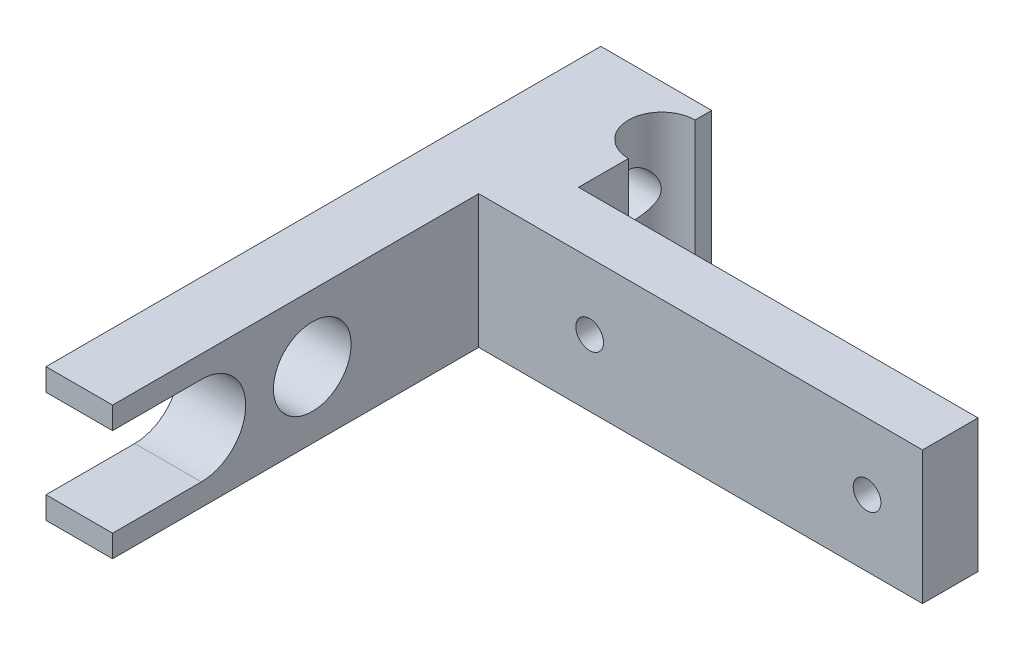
ISO-10303-21;
HEADER;
FILE_DESCRIPTION(('STEP AP214'),'2;1');
FILE_NAME('part.step','',(''),(''),'','','');
FILE_SCHEMA(('AUTOMOTIVE_DESIGN { 1 0 10303 214 1 1 1 1 }'));
ENDSEC;
DATA;
#1=APPLICATION_CONTEXT('core data for automotive mechanical design processes');
#2=APPLICATION_PROTOCOL_DEFINITION('international standard','automotive_design',2000,#1);
#3=PRODUCT_CONTEXT('',#1,'mechanical');
#4=PRODUCT('Part','Part','',(#3));
#5=PRODUCT_RELATED_PRODUCT_CATEGORY('part','',(#4));
#6=PRODUCT_DEFINITION_FORMATION('','',#4);
#7=PRODUCT_DEFINITION_CONTEXT('part definition',#1,'design');
#8=PRODUCT_DEFINITION('design','',#6,#7);
#9=PRODUCT_DEFINITION_SHAPE('','',#8);
#10=(LENGTH_UNIT() NAMED_UNIT(*) SI_UNIT(.MILLI.,.METRE.));
#11=(NAMED_UNIT(*) PLANE_ANGLE_UNIT() SI_UNIT($,.RADIAN.));
#12=(NAMED_UNIT(*) SI_UNIT($,.STERADIAN.) SOLID_ANGLE_UNIT());
#13=UNCERTAINTY_MEASURE_WITH_UNIT(LENGTH_MEASURE(1.E-05),#10,'distance_accuracy_value','');
#14=(GEOMETRIC_REPRESENTATION_CONTEXT(3) GLOBAL_UNCERTAINTY_ASSIGNED_CONTEXT((#13)) GLOBAL_UNIT_ASSIGNED_CONTEXT((#10,
#11,#12)) REPRESENTATION_CONTEXT('',''));
#15=CARTESIAN_POINT('',(0.,0.,0.));
#16=DIRECTION('',(0.,0.,1.));
#17=DIRECTION('',(1.,0.,0.));
#18=AXIS2_PLACEMENT_3D('',#15,#16,#17);
#19=CARTESIAN_POINT('',(-26.,6.,27.5));
#20=DIRECTION('',(-1.,0.,0.));
#21=DIRECTION('',(0.,0.,1.));
#22=AXIS2_PLACEMENT_3D('',#19,#20,#21);
#23=CYLINDRICAL_SURFACE('',#22,3.5);
#24=CARTESIAN_POINT('',(-20.,6.,27.5));
#25=DIRECTION('',(-1.,0.,0.));
#26=DIRECTION('',(0.,0.,1.));
#27=AXIS2_PLACEMENT_3D('',#24,#25,#26);
#28=CIRCLE('',#27,3.5);
#29=CARTESIAN_POINT('',(-20.,6.,31.));
#30=VERTEX_POINT('',#29);
#31=EDGE_CURVE('E198',#30,#30,#28,.T.);
#32=ORIENTED_EDGE('',*,*,#31,.F.);
#33=EDGE_LOOP('',(#32));
#34=FACE_BOUND('',#33,.T.);
#35=CARTESIAN_POINT('',(-26.,6.,27.5));
#36=DIRECTION('',(-1.,0.,0.));
#37=DIRECTION('',(0.,0.,1.));
#38=AXIS2_PLACEMENT_3D('',#35,#36,#37);
#39=CIRCLE('',#38,3.5);
#40=CARTESIAN_POINT('',(-26.,6.,31.));
#41=VERTEX_POINT('',#40);
#42=EDGE_CURVE('E297',#41,#41,#39,.T.);
#43=ORIENTED_EDGE('',*,*,#42,.T.);
#44=EDGE_LOOP('',(#43));
#45=FACE_BOUND('',#44,.T.);
#46=ADVANCED_FACE('F17',(#34,#45),#23,.F.);
#47=CARTESIAN_POINT('',(-20.,2.00000000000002,45.5));
#48=DIRECTION('',(0.,-1.,0.));
#49=DIRECTION('',(0.,0.,-1.));
#50=AXIS2_PLACEMENT_3D('',#47,#48,#49);
#51=PLANE('',#50);
#52=DIRECTION('',(-1.,0.,0.));
#53=VECTOR('',#52,1.);
#54=CARTESIAN_POINT('',(-26.,2.00000000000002,45.5));
#55=LINE('',#54,#53);
#56=CARTESIAN_POINT('',(-26.,2.00000000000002,45.5));
#57=VERTEX_POINT('',#56);
#58=CARTESIAN_POINT('',(-20.,2.00000000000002,45.5));
#59=VERTEX_POINT('',#58);
#60=EDGE_CURVE('E274',#57,#59,#55,.F.);
#61=ORIENTED_EDGE('',*,*,#60,.T.);
#62=DIRECTION('',(0.,0.,-1.));
#63=VECTOR('',#62,1.);
#64=CARTESIAN_POINT('',(-20.,2.00000000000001,0.));
#65=LINE('',#64,#63);
#66=CARTESIAN_POINT('',(-20.,2.00000000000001,37.5));
#67=VERTEX_POINT('',#66);
#68=EDGE_CURVE('E194',#67,#59,#65,.F.);
#69=ORIENTED_EDGE('',*,*,#68,.F.);
#70=DIRECTION('',(-1.,0.,0.));
#71=VECTOR('',#70,1.);
#72=CARTESIAN_POINT('',(-20.,2.00000000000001,37.5));
#73=LINE('',#72,#71);
#74=CARTESIAN_POINT('',(-26.,2.00000000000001,37.5));
#75=VERTEX_POINT('',#74);
#76=EDGE_CURVE('E249',#67,#75,#73,.T.);
#77=ORIENTED_EDGE('',*,*,#76,.T.);
#78=DIRECTION('',(0.,0.,-1.));
#79=VECTOR('',#78,1.);
#80=CARTESIAN_POINT('',(-26.,2.00000000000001,0.));
#81=LINE('',#80,#79);
#82=EDGE_CURVE('E93',#75,#57,#81,.F.);
#83=ORIENTED_EDGE('',*,*,#82,.T.);
#84=EDGE_LOOP('',(#61,#69,#77,#83));
#85=FACE_BOUND('',#84,.T.);
#86=ADVANCED_FACE('F465',(#85),#51,.F.);
#87=CARTESIAN_POINT('',(-26.,12.,45.5));
#88=DIRECTION('',(0.,0.,-1.));
#89=DIRECTION('',(-1.,0.,0.));
#90=AXIS2_PLACEMENT_3D('',#87,#88,#89);
#91=PLANE('',#90);
#92=ORIENTED_EDGE('',*,*,#60,.F.);
#93=DIRECTION('',(0.,1.,0.));
#94=VECTOR('',#93,1.);
#95=CARTESIAN_POINT('',(-26.,0.,45.5));
#96=LINE('',#95,#94);
#97=CARTESIAN_POINT('',(-26.,0.,45.5));
#98=VERTEX_POINT('',#97);
#99=EDGE_CURVE('E221',#57,#98,#96,.F.);
#100=ORIENTED_EDGE('',*,*,#99,.T.);
#101=DIRECTION('',(1.,0.,0.));
#102=VECTOR('',#101,1.);
#103=CARTESIAN_POINT('',(0.,0.,45.5));
#104=LINE('',#103,#102);
#105=CARTESIAN_POINT('',(-20.,0.,45.5));
#106=VERTEX_POINT('',#105);
#107=EDGE_CURVE('E245',#98,#106,#104,.T.);
#108=ORIENTED_EDGE('',*,*,#107,.T.);
#109=DIRECTION('',(0.,1.,0.));
#110=VECTOR('',#109,1.);
#111=CARTESIAN_POINT('',(-20.,0.,45.5));
#112=LINE('',#111,#110);
#113=EDGE_CURVE('E197',#59,#106,#112,.F.);
#114=ORIENTED_EDGE('',*,*,#113,.F.);
#115=EDGE_LOOP('',(#92,#100,#108,#114));
#116=FACE_BOUND('',#115,.T.);
#117=ADVANCED_FACE('F456',(#116),#91,.F.);
#118=CARTESIAN_POINT('',(-20.,10.,45.5));
#119=DIRECTION('',(0.,1.,0.));
#120=DIRECTION('',(0.,0.,1.));
#121=AXIS2_PLACEMENT_3D('',#118,#119,#120);
#122=PLANE('',#121);
#123=DIRECTION('',(-1.,0.,0.));
#124=VECTOR('',#123,1.);
#125=CARTESIAN_POINT('',(-20.,10.,37.5));
#126=LINE('',#125,#124);
#127=CARTESIAN_POINT('',(-26.,10.,37.5));
#128=VERTEX_POINT('',#127);
#129=CARTESIAN_POINT('',(-20.,10.,37.5));
#130=VERTEX_POINT('',#129);
#131=EDGE_CURVE('E272',#128,#130,#126,.F.);
#132=ORIENTED_EDGE('',*,*,#131,.T.);
#133=DIRECTION('',(0.,0.,-1.));
#134=VECTOR('',#133,1.);
#135=CARTESIAN_POINT('',(-20.,10.,0.));
#136=LINE('',#135,#134);
#137=CARTESIAN_POINT('',(-20.,10.,45.5));
#138=VERTEX_POINT('',#137);
#139=EDGE_CURVE('E187',#138,#130,#136,.T.);
#140=ORIENTED_EDGE('',*,*,#139,.F.);
#141=DIRECTION('',(-1.,0.,0.));
#142=VECTOR('',#141,1.);
#143=CARTESIAN_POINT('',(-26.,10.,45.5));
#144=LINE('',#143,#142);
#145=CARTESIAN_POINT('',(-26.,10.,45.5));
#146=VERTEX_POINT('',#145);
#147=EDGE_CURVE('E97',#138,#146,#144,.T.);
#148=ORIENTED_EDGE('',*,*,#147,.T.);
#149=DIRECTION('',(0.,0.,-1.));
#150=VECTOR('',#149,1.);
#151=CARTESIAN_POINT('',(-26.,10.,0.));
#152=LINE('',#151,#150);
#153=EDGE_CURVE('E64',#146,#128,#152,.T.);
#154=ORIENTED_EDGE('',*,*,#153,.T.);
#155=EDGE_LOOP('',(#132,#140,#148,#154));
#156=FACE_BOUND('',#155,.T.);
#157=ADVANCED_FACE('F446',(#156),#122,.F.);
#158=CARTESIAN_POINT('',(-20.,6.00000000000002,37.5));
#159=DIRECTION('',(-1.,0.,0.));
#160=DIRECTION('',(0.,0.,1.));
#161=AXIS2_PLACEMENT_3D('',#158,#159,#160);
#162=CYLINDRICAL_SURFACE('',#161,4.);
#163=ORIENTED_EDGE('',*,*,#76,.F.);
#164=CARTESIAN_POINT('',(-20.,6.00000000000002,37.5));
#165=DIRECTION('',(-1.,0.,0.));
#166=DIRECTION('',(0.,0.,1.));
#167=AXIS2_PLACEMENT_3D('',#164,#165,#166);
#168=CIRCLE('',#167,4.);
#169=EDGE_CURVE('E190',#130,#67,#168,.T.);
#170=ORIENTED_EDGE('',*,*,#169,.F.);
#171=ORIENTED_EDGE('',*,*,#131,.F.);
#172=CARTESIAN_POINT('',(-26.,6.00000000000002,37.5));
#173=DIRECTION('',(-1.,0.,0.));
#174=DIRECTION('',(0.,0.,1.));
#175=AXIS2_PLACEMENT_3D('',#172,#173,#174);
#176=CIRCLE('',#175,4.);
#177=EDGE_CURVE('E222',#128,#75,#176,.T.);
#178=ORIENTED_EDGE('',*,*,#177,.T.);
#179=EDGE_LOOP('',(#163,#170,#171,#178));
#180=FACE_BOUND('',#179,.T.);
#181=ADVANCED_FACE('F435',(#180),#162,.F.);
#182=CARTESIAN_POINT('',(-9.99999999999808,6.00000000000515,12.5));
#183=DIRECTION('',(0.,0.,1.));
#184=DIRECTION('',(1.,0.,0.));
#185=AXIS2_PLACEMENT_3D('',#182,#183,#184);
#186=CYLINDRICAL_SURFACE('',#185,1.24999999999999);
#187=CARTESIAN_POINT('',(-9.99999999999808,6.00000000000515,7.50000000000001));
#188=DIRECTION('',(0.,0.,1.));
#189=DIRECTION('',(1.,0.,0.));
#190=AXIS2_PLACEMENT_3D('',#187,#188,#189);
#191=CIRCLE('',#190,1.24999999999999);
#192=CARTESIAN_POINT('',(-8.74999999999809,6.00000000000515,7.50000000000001));
#193=VERTEX_POINT('',#192);
#194=EDGE_CURVE('E262',#193,#193,#191,.F.);
#195=ORIENTED_EDGE('',*,*,#194,.T.);
#196=EDGE_LOOP('',(#195));
#197=FACE_BOUND('',#196,.T.);
#198=CARTESIAN_POINT('',(-9.99999999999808,6.00000000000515,12.5));
#199=DIRECTION('',(0.,0.,1.));
#200=DIRECTION('',(1.,0.,0.));
#201=AXIS2_PLACEMENT_3D('',#198,#199,#200);
#202=CIRCLE('',#201,1.24999999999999);
#203=CARTESIAN_POINT('',(-8.74999999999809,6.00000000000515,12.5));
#204=VERTEX_POINT('',#203);
#205=EDGE_CURVE('E527',#204,#204,#202,.T.);
#206=ORIENTED_EDGE('',*,*,#205,.T.);
#207=EDGE_LOOP('',(#206));
#208=FACE_BOUND('',#207,.T.);
#209=ADVANCED_FACE('F426',(#197,#208),#186,.F.);
#210=CARTESIAN_POINT('',(15.0000000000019,6.00000000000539,12.5));
#211=DIRECTION('',(0.,0.,1.));
#212=DIRECTION('',(1.,0.,0.));
#213=AXIS2_PLACEMENT_3D('',#210,#211,#212);
#214=CYLINDRICAL_SURFACE('',#213,1.24999999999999);
#215=CARTESIAN_POINT('',(15.0000000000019,6.00000000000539,7.5));
#216=DIRECTION('',(0.,0.,1.));
#217=DIRECTION('',(1.,0.,0.));
#218=AXIS2_PLACEMENT_3D('',#215,#216,#217);
#219=CIRCLE('',#218,1.24999999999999);
#220=CARTESIAN_POINT('',(16.2500000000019,6.00000000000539,7.5));
#221=VERTEX_POINT('',#220);
#222=EDGE_CURVE('E257',#221,#221,#219,.F.);
#223=ORIENTED_EDGE('',*,*,#222,.T.);
#224=EDGE_LOOP('',(#223));
#225=FACE_BOUND('',#224,.T.);
#226=CARTESIAN_POINT('',(15.0000000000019,6.00000000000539,12.5));
#227=DIRECTION('',(0.,0.,1.));
#228=DIRECTION('',(1.,0.,0.));
#229=AXIS2_PLACEMENT_3D('',#226,#227,#228);
#230=CIRCLE('',#229,1.24999999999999);
#231=CARTESIAN_POINT('',(16.2500000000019,6.00000000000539,12.5));
#232=VERTEX_POINT('',#231);
#233=EDGE_CURVE('E179',#232,#232,#230,.T.);
#234=ORIENTED_EDGE('',*,*,#233,.T.);
#235=EDGE_LOOP('',(#234));
#236=FACE_BOUND('',#235,.T.);
#237=ADVANCED_FACE('F356',(#225,#236),#214,.F.);
#238=CARTESIAN_POINT('',(-20.,6.,0.));
#239=DIRECTION('',(-1.,0.,0.));
#240=DIRECTION('',(0.,0.,1.));
#241=AXIS2_PLACEMENT_3D('',#238,#239,#240);
#242=CYLINDRICAL_SURFACE('',#241,2.1);
#243=CARTESIAN_POINT('',(-18.1424285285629,6.,-2.1));
#244=CARTESIAN_POINT('',(-18.1424280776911,6.05039333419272,-2.10000024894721));
#245=CARTESIAN_POINT('',(-18.1442163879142,6.10078351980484,-2.09818120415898));
#246=CARTESIAN_POINT('',(-18.1512598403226,6.20107079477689,-2.0909576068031));
#247=CARTESIAN_POINT('',(-18.1565165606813,6.25096764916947,-2.08555142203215));
#248=CARTESIAN_POINT('',(-18.177144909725,6.39940299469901,-2.06408674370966));
#249=CARTESIAN_POINT('',(-18.1973737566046,6.4965652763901,-2.04278253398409));
#250=CARTESIAN_POINT('',(-18.2469956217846,6.68344251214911,-1.98804637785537));
#251=CARTESIAN_POINT('',(-18.2762834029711,6.77322872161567,-1.95475301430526));
#252=CARTESIAN_POINT('',(-18.3405234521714,6.94575514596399,-1.87736056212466));
#253=CARTESIAN_POINT('',(-18.37547599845,7.02849501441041,-1.83326094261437));
#254=CARTESIAN_POINT('',(-18.4544211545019,7.20042014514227,-1.72654314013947));
#255=CARTESIAN_POINT('',(-18.4989248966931,7.28819622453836,-1.66203431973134));
#256=CARTESIAN_POINT('',(-18.5877056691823,7.45293684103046,-1.52013310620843));
#257=CARTESIAN_POINT('',(-18.63198235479,7.52988799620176,-1.44272502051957));
#258=CARTESIAN_POINT('',(-18.7239628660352,7.68355867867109,-1.26173288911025));
#259=CARTESIAN_POINT('',(-18.7710093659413,7.75810524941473,-1.15593645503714));
#260=CARTESIAN_POINT('',(-18.8549423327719,7.88762273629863,-0.92940951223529));
#261=CARTESIAN_POINT('',(-18.8918490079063,7.9426326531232,-0.808709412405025));
#262=CARTESIAN_POINT('',(-18.9429512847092,8.01779371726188,-0.589969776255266));
#263=CARTESIAN_POINT('',(-18.9605859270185,8.04334197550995,-0.494573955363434));
#264=CARTESIAN_POINT('',(-18.9865784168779,8.08082627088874,-0.299929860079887));
#265=CARTESIAN_POINT('',(-18.9949437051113,8.09277322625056,-0.200684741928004));
#266=CARTESIAN_POINT('',(-19.0016667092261,8.10238308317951,-0.000967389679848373));
#267=CARTESIAN_POINT('',(-19.0000049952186,8.10001825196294,0.0995068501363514));
#268=CARTESIAN_POINT('',(-18.9867830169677,8.08108575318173,0.298449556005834));
#269=CARTESIAN_POINT('',(-18.9752199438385,8.06451405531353,0.396917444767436));
#270=CARTESIAN_POINT('',(-18.9435710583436,8.0186326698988,0.586910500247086));
#271=CARTESIAN_POINT('',(-18.923685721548,7.98962224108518,0.678542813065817));
#272=CARTESIAN_POINT('',(-18.8769087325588,7.92022379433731,0.855440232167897));
#273=CARTESIAN_POINT('',(-18.8500157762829,7.87983365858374,0.940704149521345));
#274=CARTESIAN_POINT('',(-18.7876310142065,7.78391816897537,1.11283746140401));
#275=CARTESIAN_POINT('',(-18.7515128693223,7.72720287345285,1.19881293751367));
#276=CARTESIAN_POINT('',(-18.6752360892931,7.60290286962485,1.36056116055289));
#277=CARTESIAN_POINT('',(-18.6350730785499,7.53530634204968,1.43632264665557));
#278=CARTESIAN_POINT('',(-18.5460478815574,7.37744794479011,1.5895973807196));
#279=CARTESIAN_POINT('',(-18.4969126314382,7.28529410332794,1.66500913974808));
#280=CARTESIAN_POINT('',(-18.4015469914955,7.08850173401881,1.79982755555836));
#281=CARTESIAN_POINT('',(-18.3553162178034,6.98386486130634,1.85923633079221));
#282=CARTESIAN_POINT('',(-18.2815772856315,6.78852001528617,1.94857682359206));
#283=CARTESIAN_POINT('',(-18.2522116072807,6.70018429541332,1.98214799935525));
#284=CARTESIAN_POINT('',(-18.2023381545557,6.5176063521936,2.03742738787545));
#285=CARTESIAN_POINT('',(-18.1818030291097,6.42338341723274,2.0591722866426));
#286=CARTESIAN_POINT('',(-18.1591649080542,6.27355704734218,2.08281944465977));
#287=CARTESIAN_POINT('',(-18.1529269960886,6.21925242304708,2.08924341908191));
#288=CARTESIAN_POINT('',(-18.1445587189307,6.10996402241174,2.09783390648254));
#289=CARTESIAN_POINT('',(-18.142429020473,6.05498013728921,2.0999997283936));
#290=CARTESIAN_POINT('',(-18.1424280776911,5.94960666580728,2.10000024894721));
#291=CARTESIAN_POINT('',(-18.1442163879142,5.89921648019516,2.09818120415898));
#292=CARTESIAN_POINT('',(-18.1512598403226,5.79892920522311,2.0909576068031));
#293=CARTESIAN_POINT('',(-18.1565165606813,5.74903235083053,2.08555142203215));
#294=CARTESIAN_POINT('',(-18.177144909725,5.60059700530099,2.06408674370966));
#295=CARTESIAN_POINT('',(-18.1973737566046,5.5034347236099,2.04278253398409));
#296=CARTESIAN_POINT('',(-18.2469956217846,5.31655748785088,1.98804637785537));
#297=CARTESIAN_POINT('',(-18.2762834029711,5.22677127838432,1.95475301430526));
#298=CARTESIAN_POINT('',(-18.3405234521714,5.054244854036,1.87736056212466));
#299=CARTESIAN_POINT('',(-18.37547599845,4.97150498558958,1.83326094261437));
#300=CARTESIAN_POINT('',(-18.4544211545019,4.79957985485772,1.72654314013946));
#301=CARTESIAN_POINT('',(-18.4989248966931,4.71180377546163,1.66203431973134));
#302=CARTESIAN_POINT('',(-18.5877056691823,4.54706315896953,1.52013310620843));
#303=CARTESIAN_POINT('',(-18.6319823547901,4.47011200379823,1.44272502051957));
#304=CARTESIAN_POINT('',(-18.7239628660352,4.3164413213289,1.26173288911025));
#305=CARTESIAN_POINT('',(-18.7710093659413,4.24189475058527,1.15593645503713));
#306=CARTESIAN_POINT('',(-18.8549423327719,4.11237726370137,0.929409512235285));
#307=CARTESIAN_POINT('',(-18.8918490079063,4.05736734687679,0.808709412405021));
#308=CARTESIAN_POINT('',(-18.9429512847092,3.98220628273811,0.589969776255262));
#309=CARTESIAN_POINT('',(-18.9605859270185,3.95665802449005,0.494573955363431));
#310=CARTESIAN_POINT('',(-18.9865784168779,3.91917372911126,0.299929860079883));
#311=CARTESIAN_POINT('',(-18.9949437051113,3.90722677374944,0.200684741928));
#312=CARTESIAN_POINT('',(-19.0016667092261,3.89761691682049,0.000967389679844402));
#313=CARTESIAN_POINT('',(-19.0000049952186,3.89998174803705,-0.099506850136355));
#314=CARTESIAN_POINT('',(-18.9867830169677,3.91891424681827,-0.298449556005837));
#315=CARTESIAN_POINT('',(-18.9752199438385,3.93548594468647,-0.396917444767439));
#316=CARTESIAN_POINT('',(-18.9435710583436,3.9813673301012,-0.586910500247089));
#317=CARTESIAN_POINT('',(-18.923685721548,4.01037775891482,-0.67854281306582));
#318=CARTESIAN_POINT('',(-18.8769087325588,4.07977620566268,-0.855440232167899));
#319=CARTESIAN_POINT('',(-18.8500157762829,4.12016634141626,-0.940704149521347));
#320=CARTESIAN_POINT('',(-18.7876310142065,4.21608183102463,-1.11283746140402));
#321=CARTESIAN_POINT('',(-18.7515128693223,4.27279712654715,-1.19881293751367));
#322=CARTESIAN_POINT('',(-18.6752360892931,4.39709713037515,-1.36056116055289));
#323=CARTESIAN_POINT('',(-18.6350730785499,4.46469365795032,-1.43632264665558));
#324=CARTESIAN_POINT('',(-18.5460478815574,4.62255205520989,-1.5895973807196));
#325=CARTESIAN_POINT('',(-18.4969126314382,4.71470589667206,-1.66500913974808));
#326=CARTESIAN_POINT('',(-18.4015469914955,4.91149826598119,-1.79982755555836));
#327=CARTESIAN_POINT('',(-18.3553162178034,5.01613513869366,-1.85923633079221));
#328=CARTESIAN_POINT('',(-18.2815772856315,5.21147998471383,-1.94857682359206));
#329=CARTESIAN_POINT('',(-18.2522116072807,5.29981570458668,-1.98214799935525));
#330=CARTESIAN_POINT('',(-18.2023381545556,5.48239364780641,-2.03742738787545));
#331=CARTESIAN_POINT('',(-18.1818030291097,5.57661658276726,-2.0591722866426));
#332=CARTESIAN_POINT('',(-18.1591649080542,5.72644295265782,-2.08281944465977));
#333=CARTESIAN_POINT('',(-18.1529269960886,5.78074757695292,-2.08924341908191));
#334=CARTESIAN_POINT('',(-18.1445587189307,5.89003597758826,-2.09783390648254));
#335=CARTESIAN_POINT('',(-18.1424290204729,5.94501986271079,-2.0999997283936));
#336=CARTESIAN_POINT('',(-18.1424285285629,6.,-2.1));
#337=B_SPLINE_CURVE_WITH_KNOTS('',3,(#243,#244,#245,#246,#247,#248,#249,#250,#251,#252,#253,
#254,#255,#256,#257,#258,#259,#260,#261,#262,#263,#264,#265,#266,#267,#268,#269,#270,#271,#272,
#273,#274,#275,#276,#277,#278,#279,#280,#281,#282,#283,#284,#285,#286,#287,#288,#289,#290,#291,
#292,#293,#294,#295,#296,#297,#298,#299,#300,#301,#302,#303,#304,#305,#306,#307,#308,#309,#310,
#311,#312,#313,#314,#315,#316,#317,#318,#319,#320,#321,#322,#323,#324,#325,#326,#327,#328,#329,
#330,#331,#332,#333,#334,#335,#336),.UNSPECIFIED.,.T.,.F.,(4,2,2,2,2,2,2,2,2,2,2,2,2,2,2,2,2,2,
2,2,2,2,2,2,2,2,2,2,2,2,2,2,2,2,2,2,2,2,2,2,2,2,2,2,2,2,4),(0.,0.1511066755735,
0.302282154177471,0.604989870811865,0.904305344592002,1.20363552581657,1.55539125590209,
1.90757808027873,2.31841941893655,2.72843592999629,3.02810538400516,3.32753411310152,
3.62754324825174,3.92763752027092,4.22088479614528,4.5141866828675,4.8404084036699,
5.16698688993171,5.55186282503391,5.93668778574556,6.23254775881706,6.52748463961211,
6.69231830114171,6.85717871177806,7.00828538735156,7.15946086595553,7.46216858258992,
7.76148405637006,8.06081423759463,8.41256996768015,8.76475679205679,9.17559813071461,
9.58561464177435,9.88528409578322,10.1847128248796,10.4847219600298,10.784816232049,
11.0780635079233,11.3713653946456,11.697587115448,12.0241656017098,12.409041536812,
12.7938664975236,13.0897264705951,13.3846633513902,13.5494970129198,13.7143574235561),.UNSPECIFIED.);
#338=CARTESIAN_POINT('',(-18.1424285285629,6.,-2.1));
#339=VERTEX_POINT('',#338);
#340=EDGE_CURVE('E253',#339,#339,#337,.T.);
#341=ORIENTED_EDGE('',*,*,#340,.T.);
#342=EDGE_LOOP('',(#341));
#343=FACE_BOUND('',#342,.T.);
#344=CARTESIAN_POINT('',(-26.,6.,0.));
#345=DIRECTION('',(-1.,0.,0.));
#346=DIRECTION('',(0.,0.,1.));
#347=AXIS2_PLACEMENT_3D('',#344,#345,#346);
#348=CIRCLE('',#347,2.1);
#349=CARTESIAN_POINT('',(-26.,6.,2.1));
#350=VERTEX_POINT('',#349);
#351=EDGE_CURVE('E20',#350,#350,#348,.T.);
#352=ORIENTED_EDGE('',*,*,#351,.T.);
#353=EDGE_LOOP('',(#352));
#354=FACE_BOUND('',#353,.T.);
#355=ADVANCED_FACE('F310',(#343,#354),#242,.F.);
#356=CARTESIAN_POINT('',(-16.,0.,-12.5));
#357=DIRECTION('',(-1.,0.,0.));
#358=DIRECTION('',(0.,0.,1.));
#359=AXIS2_PLACEMENT_3D('',#356,#357,#358);
#360=PLANE('',#359);
#361=DIRECTION('',(0.,1.,0.));
#362=VECTOR('',#361,1.);
#363=CARTESIAN_POINT('',(-16.,0.,-4.5));
#364=LINE('',#363,#362);
#365=CARTESIAN_POINT('',(-16.,0.,-4.5));
#366=VERTEX_POINT('',#365);
#367=CARTESIAN_POINT('',(-16.,12.,-4.5));
#368=VERTEX_POINT('',#367);
#369=EDGE_CURVE('E238',#366,#368,#364,.T.);
#370=ORIENTED_EDGE('',*,*,#369,.T.);
#371=DIRECTION('',(0.,0.,1.));
#372=VECTOR('',#371,1.);
#373=CARTESIAN_POINT('',(-16.,12.,-12.5));
#374=LINE('',#373,#372);
#375=CARTESIAN_POINT('',(-16.,12.,-3.));
#376=VERTEX_POINT('',#375);
#377=EDGE_CURVE('E35',#376,#368,#374,.F.);
#378=ORIENTED_EDGE('',*,*,#377,.F.);
#379=DIRECTION('',(0.,1.,0.));
#380=VECTOR('',#379,1.);
#381=CARTESIAN_POINT('',(-16.,0.,-3.));
#382=LINE('',#381,#380);
#383=CARTESIAN_POINT('',(-16.,0.,-3.));
#384=VERTEX_POINT('',#383);
#385=EDGE_CURVE('E302',#376,#384,#382,.F.);
#386=ORIENTED_EDGE('',*,*,#385,.T.);
#387=DIRECTION('',(0.,0.,1.));
#388=VECTOR('',#387,1.);
#389=CARTESIAN_POINT('',(-16.,0.,0.));
#390=LINE('',#389,#388);
#391=EDGE_CURVE('E243',#384,#366,#390,.F.);
#392=ORIENTED_EDGE('',*,*,#391,.T.);
#393=EDGE_LOOP('',(#370,#378,#386,#392));
#394=FACE_BOUND('',#393,.T.);
#395=ADVANCED_FACE('F350',(#394),#360,.F.);
#396=CARTESIAN_POINT('',(0.,0.,0.));
#397=DIRECTION('',(0.,1.,0.));
#398=DIRECTION('',(0.,0.,1.));
#399=AXIS2_PLACEMENT_3D('',#396,#397,#398);
#400=PLANE('',#399);
#401=DIRECTION('',(0.,0.,-1.));
#402=VECTOR('',#401,1.);
#403=CARTESIAN_POINT('',(-20.,0.,0.));
#404=LINE('',#403,#402);
#405=CARTESIAN_POINT('',(-20.,0.,12.5));
#406=VERTEX_POINT('',#405);
#407=EDGE_CURVE('E203',#106,#406,#404,.T.);
#408=ORIENTED_EDGE('',*,*,#407,.F.);
#409=ORIENTED_EDGE('',*,*,#107,.F.);
#410=DIRECTION('',(0.,0.,-1.));
#411=VECTOR('',#410,1.);
#412=CARTESIAN_POINT('',(-26.,0.,0.));
#413=LINE('',#412,#411);
#414=CARTESIAN_POINT('',(-26.,0.,-4.5));
#415=VERTEX_POINT('',#414);
#416=EDGE_CURVE('E75',#98,#415,#413,.T.);
#417=ORIENTED_EDGE('',*,*,#416,.T.);
#418=DIRECTION('',(1.,0.,0.));
#419=VECTOR('',#418,1.);
#420=CARTESIAN_POINT('',(-20.,0.,-4.5));
#421=LINE('',#420,#419);
#422=EDGE_CURVE('E240',#415,#366,#421,.T.);
#423=ORIENTED_EDGE('',*,*,#422,.T.);
#424=ORIENTED_EDGE('',*,*,#391,.F.);
#425=CARTESIAN_POINT('',(-16.,0.,0.));
#426=DIRECTION('',(0.,1.,0.));
#427=DIRECTION('',(0.,0.,1.));
#428=AXIS2_PLACEMENT_3D('',#425,#426,#427);
#429=CIRCLE('',#428,3.);
#430=CARTESIAN_POINT('',(-16.,0.,3.00000000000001));
#431=VERTEX_POINT('',#430);
#432=EDGE_CURVE('E235',#384,#431,#429,.T.);
#433=ORIENTED_EDGE('',*,*,#432,.T.);
#434=DIRECTION('',(0.,0.,1.));
#435=VECTOR('',#434,1.);
#436=CARTESIAN_POINT('',(-16.,0.,-12.5));
#437=LINE('',#436,#435);
#438=CARTESIAN_POINT('',(-16.,0.,7.5));
#439=VERTEX_POINT('',#438);
#440=EDGE_CURVE('E140',#431,#439,#437,.T.);
#441=ORIENTED_EDGE('',*,*,#440,.T.);
#442=DIRECTION('',(1.,0.,0.));
#443=VECTOR('',#442,1.);
#444=CARTESIAN_POINT('',(20.,0.,7.5));
#445=LINE('',#444,#443);
#446=CARTESIAN_POINT('',(20.,0.,7.5));
#447=VERTEX_POINT('',#446);
#448=EDGE_CURVE('E137',#439,#447,#445,.T.);
#449=ORIENTED_EDGE('',*,*,#448,.T.);
#450=DIRECTION('',(0.,0.,1.));
#451=VECTOR('',#450,1.);
#452=CARTESIAN_POINT('',(20.,0.,-12.5));
#453=LINE('',#452,#451);
#454=CARTESIAN_POINT('',(20.,0.,12.5));
#455=VERTEX_POINT('',#454);
#456=EDGE_CURVE('E169',#447,#455,#453,.T.);
#457=ORIENTED_EDGE('',*,*,#456,.T.);
#458=DIRECTION('',(-1.,0.,0.));
#459=VECTOR('',#458,1.);
#460=CARTESIAN_POINT('',(-20.,0.,12.5));
#461=LINE('',#460,#459);
#462=EDGE_CURVE('E170',#455,#406,#461,.T.);
#463=ORIENTED_EDGE('',*,*,#462,.T.);
#464=EDGE_LOOP('',(#408,#409,#417,#423,#424,#433,#441,#449,#457,#463));
#465=FACE_BOUND('',#464,.T.);
#466=ADVANCED_FACE('F347',(#465),#400,.F.);
#467=CARTESIAN_POINT('',(-20.,0.,-4.5));
#468=DIRECTION('',(0.,0.,1.));
#469=DIRECTION('',(1.,0.,0.));
#470=AXIS2_PLACEMENT_3D('',#467,#468,#469);
#471=PLANE('',#470);
#472=ORIENTED_EDGE('',*,*,#369,.F.);
#473=ORIENTED_EDGE('',*,*,#422,.F.);
#474=DIRECTION('',(0.,1.,0.));
#475=VECTOR('',#474,1.);
#476=CARTESIAN_POINT('',(-26.,0.,-4.5));
#477=LINE('',#476,#475);
#478=CARTESIAN_POINT('',(-26.,12.,-4.5));
#479=VERTEX_POINT('',#478);
#480=EDGE_CURVE('E226',#415,#479,#477,.T.);
#481=ORIENTED_EDGE('',*,*,#480,.T.);
#482=DIRECTION('',(1.,0.,0.));
#483=VECTOR('',#482,1.);
#484=CARTESIAN_POINT('',(0.,12.,-4.5));
#485=LINE('',#484,#483);
#486=EDGE_CURVE('E217',#368,#479,#485,.F.);
#487=ORIENTED_EDGE('',*,*,#486,.F.);
#488=EDGE_LOOP('',(#472,#473,#481,#487));
#489=FACE_BOUND('',#488,.T.);
#490=ADVANCED_FACE('F343',(#489),#471,.F.);
#491=CARTESIAN_POINT('',(-26.,0.,0.));
#492=DIRECTION('',(1.,0.,0.));
#493=DIRECTION('',(0.,0.,-1.));
#494=AXIS2_PLACEMENT_3D('',#491,#492,#493);
#495=PLANE('',#494);
#496=ORIENTED_EDGE('',*,*,#82,.F.);
#497=ORIENTED_EDGE('',*,*,#177,.F.);
#498=ORIENTED_EDGE('',*,*,#153,.F.);
#499=DIRECTION('',(0.,1.,0.));
#500=VECTOR('',#499,1.);
#501=CARTESIAN_POINT('',(-26.,12.,45.5));
#502=LINE('',#501,#500);
#503=CARTESIAN_POINT('',(-26.,12.,45.5));
#504=VERTEX_POINT('',#503);
#505=EDGE_CURVE('E211',#146,#504,#502,.T.);
#506=ORIENTED_EDGE('',*,*,#505,.T.);
#507=DIRECTION('',(0.,0.,1.));
#508=VECTOR('',#507,1.);
#509=CARTESIAN_POINT('',(-26.,12.,0.));
#510=LINE('',#509,#508);
#511=EDGE_CURVE('E208',#479,#504,#510,.T.);
#512=ORIENTED_EDGE('',*,*,#511,.F.);
#513=ORIENTED_EDGE('',*,*,#480,.F.);
#514=ORIENTED_EDGE('',*,*,#416,.F.);
#515=ORIENTED_EDGE('',*,*,#99,.F.);
#516=EDGE_LOOP('',(#496,#497,#498,#506,#512,#513,#514,#515));
#517=FACE_BOUND('',#516,.T.);
#518=ORIENTED_EDGE('',*,*,#42,.F.);
#519=EDGE_LOOP('',(#518));
#520=FACE_BOUND('',#519,.T.);
#521=ORIENTED_EDGE('',*,*,#351,.F.);
#522=EDGE_LOOP('',(#521));
#523=FACE_BOUND('',#522,.T.);
#524=ADVANCED_FACE('F339',(#517,#520,#523),#495,.F.);
#525=CARTESIAN_POINT('',(-26.,12.,45.5));
#526=DIRECTION('',(0.,0.,-1.));
#527=DIRECTION('',(-1.,0.,0.));
#528=AXIS2_PLACEMENT_3D('',#525,#526,#527);
#529=PLANE('',#528);
#530=ORIENTED_EDGE('',*,*,#147,.F.);
#531=DIRECTION('',(0.,1.,0.));
#532=VECTOR('',#531,1.);
#533=CARTESIAN_POINT('',(-20.,0.,45.5));
#534=LINE('',#533,#532);
#535=CARTESIAN_POINT('',(-20.,12.,45.5));
#536=VERTEX_POINT('',#535);
#537=EDGE_CURVE('E191',#536,#138,#534,.F.);
#538=ORIENTED_EDGE('',*,*,#537,.F.);
#539=DIRECTION('',(1.,0.,0.));
#540=VECTOR('',#539,1.);
#541=CARTESIAN_POINT('',(0.,12.,45.5));
#542=LINE('',#541,#540);
#543=EDGE_CURVE('E184',#504,#536,#542,.T.);
#544=ORIENTED_EDGE('',*,*,#543,.F.);
#545=ORIENTED_EDGE('',*,*,#505,.F.);
#546=EDGE_LOOP('',(#530,#538,#544,#545));
#547=FACE_BOUND('',#546,.T.);
#548=ADVANCED_FACE('F335',(#547),#529,.F.);
#549=CARTESIAN_POINT('',(-20.,0.,0.));
#550=DIRECTION('',(1.,0.,0.));
#551=DIRECTION('',(0.,0.,-1.));
#552=AXIS2_PLACEMENT_3D('',#549,#550,#551);
#553=PLANE('',#552);
#554=ORIENTED_EDGE('',*,*,#139,.T.);
#555=ORIENTED_EDGE('',*,*,#169,.T.);
#556=ORIENTED_EDGE('',*,*,#68,.T.);
#557=ORIENTED_EDGE('',*,*,#113,.T.);
#558=ORIENTED_EDGE('',*,*,#407,.T.);
#559=DIRECTION('',(0.,1.,0.));
#560=VECTOR('',#559,1.);
#561=CARTESIAN_POINT('',(-20.,12.,12.5));
#562=LINE('',#561,#560);
#563=CARTESIAN_POINT('',(-20.,12.,12.5));
#564=VERTEX_POINT('',#563);
#565=EDGE_CURVE('E177',#406,#564,#562,.T.);
#566=ORIENTED_EDGE('',*,*,#565,.T.);
#567=DIRECTION('',(0.,0.,1.));
#568=VECTOR('',#567,1.);
#569=CARTESIAN_POINT('',(-20.,12.,0.));
#570=LINE('',#569,#568);
#571=EDGE_CURVE('E174',#536,#564,#570,.F.);
#572=ORIENTED_EDGE('',*,*,#571,.F.);
#573=ORIENTED_EDGE('',*,*,#537,.T.);
#574=EDGE_LOOP('',(#554,#555,#556,#557,#558,#566,#572,#573));
#575=FACE_BOUND('',#574,.T.);
#576=ORIENTED_EDGE('',*,*,#31,.T.);
#577=EDGE_LOOP('',(#576));
#578=FACE_BOUND('',#577,.T.);
#579=ADVANCED_FACE('F331',(#575,#578),#553,.T.);
#580=CARTESIAN_POINT('',(-20.,12.,12.5));
#581=DIRECTION('',(0.,0.,-1.));
#582=DIRECTION('',(-1.,0.,0.));
#583=AXIS2_PLACEMENT_3D('',#580,#581,#582);
#584=PLANE('',#583);
#585=DIRECTION('',(0.,1.,0.));
#586=VECTOR('',#585,1.);
#587=CARTESIAN_POINT('',(20.,12.,12.5));
#588=LINE('',#587,#586);
#589=CARTESIAN_POINT('',(20.,12.,12.5));
#590=VERTEX_POINT('',#589);
#591=EDGE_CURVE('E167',#455,#590,#588,.T.);
#592=ORIENTED_EDGE('',*,*,#591,.T.);
#593=DIRECTION('',(1.,0.,0.));
#594=VECTOR('',#593,1.);
#595=CARTESIAN_POINT('',(0.,12.,12.5));
#596=LINE('',#595,#594);
#597=EDGE_CURVE('E155',#564,#590,#596,.T.);
#598=ORIENTED_EDGE('',*,*,#597,.F.);
#599=ORIENTED_EDGE('',*,*,#565,.F.);
#600=ORIENTED_EDGE('',*,*,#462,.F.);
#601=EDGE_LOOP('',(#592,#598,#599,#600));
#602=FACE_BOUND('',#601,.T.);
#603=ORIENTED_EDGE('',*,*,#233,.F.);
#604=EDGE_LOOP('',(#603));
#605=FACE_BOUND('',#604,.T.);
#606=ORIENTED_EDGE('',*,*,#205,.F.);
#607=EDGE_LOOP('',(#606));
#608=FACE_BOUND('',#607,.T.);
#609=ADVANCED_FACE('F327',(#602,#605,#608),#584,.F.);
#610=CARTESIAN_POINT('',(20.,12.,-12.5));
#611=DIRECTION('',(-1.,0.,0.));
#612=DIRECTION('',(0.,0.,1.));
#613=AXIS2_PLACEMENT_3D('',#610,#611,#612);
#614=PLANE('',#613);
#615=DIRECTION('',(0.,1.,0.));
#616=VECTOR('',#615,1.);
#617=CARTESIAN_POINT('',(20.,0.,7.5));
#618=LINE('',#617,#616);
#619=CARTESIAN_POINT('',(20.,12.,7.5));
#620=VERTEX_POINT('',#619);
#621=EDGE_CURVE('E141',#447,#620,#618,.T.);
#622=ORIENTED_EDGE('',*,*,#621,.T.);
#623=DIRECTION('',(0.,0.,1.));
#624=VECTOR('',#623,1.);
#625=CARTESIAN_POINT('',(20.,12.,0.));
#626=LINE('',#625,#624);
#627=EDGE_CURVE('E153',#590,#620,#626,.F.);
#628=ORIENTED_EDGE('',*,*,#627,.F.);
#629=ORIENTED_EDGE('',*,*,#591,.F.);
#630=ORIENTED_EDGE('',*,*,#456,.F.);
#631=EDGE_LOOP('',(#622,#628,#629,#630));
#632=FACE_BOUND('',#631,.T.);
#633=ADVANCED_FACE('F324',(#632),#614,.F.);
#634=CARTESIAN_POINT('',(20.,0.,7.5));
#635=DIRECTION('',(0.,0.,1.));
#636=DIRECTION('',(1.,0.,0.));
#637=AXIS2_PLACEMENT_3D('',#634,#635,#636);
#638=PLANE('',#637);
#639=ORIENTED_EDGE('',*,*,#621,.F.);
#640=ORIENTED_EDGE('',*,*,#448,.F.);
#641=DIRECTION('',(0.,1.,0.));
#642=VECTOR('',#641,1.);
#643=CARTESIAN_POINT('',(-16.,0.,7.50000000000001));
#644=LINE('',#643,#642);
#645=CARTESIAN_POINT('',(-16.,12.,7.5));
#646=VERTEX_POINT('',#645);
#647=EDGE_CURVE('E129',#439,#646,#644,.T.);
#648=ORIENTED_EDGE('',*,*,#647,.T.);
#649=DIRECTION('',(1.,0.,0.));
#650=VECTOR('',#649,1.);
#651=CARTESIAN_POINT('',(0.,12.,7.5));
#652=LINE('',#651,#650);
#653=EDGE_CURVE('E135',#620,#646,#652,.F.);
#654=ORIENTED_EDGE('',*,*,#653,.F.);
#655=EDGE_LOOP('',(#639,#640,#648,#654));
#656=FACE_BOUND('',#655,.T.);
#657=ORIENTED_EDGE('',*,*,#222,.F.);
#658=EDGE_LOOP('',(#657));
#659=FACE_BOUND('',#658,.T.);
#660=ORIENTED_EDGE('',*,*,#194,.F.);
#661=EDGE_LOOP('',(#660));
#662=FACE_BOUND('',#661,.T.);
#663=ADVANCED_FACE('F132',(#656,#659,#662),#638,.F.);
#664=CARTESIAN_POINT('',(-16.,0.,-12.5));
#665=DIRECTION('',(-1.,0.,0.));
#666=DIRECTION('',(0.,0.,1.));
#667=AXIS2_PLACEMENT_3D('',#664,#665,#666);
#668=PLANE('',#667);
#669=DIRECTION('',(0.,1.,0.));
#670=VECTOR('',#669,1.);
#671=CARTESIAN_POINT('',(-16.,0.,3.00000000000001));
#672=LINE('',#671,#670);
#673=CARTESIAN_POINT('',(-16.,12.,3.00000000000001));
#674=VERTEX_POINT('',#673);
#675=EDGE_CURVE('E146',#431,#674,#672,.T.);
#676=ORIENTED_EDGE('',*,*,#675,.T.);
#677=DIRECTION('',(0.,0.,1.));
#678=VECTOR('',#677,1.);
#679=CARTESIAN_POINT('',(-16.,12.,0.));
#680=LINE('',#679,#678);
#681=EDGE_CURVE('E26',#646,#674,#680,.F.);
#682=ORIENTED_EDGE('',*,*,#681,.F.);
#683=ORIENTED_EDGE('',*,*,#647,.F.);
#684=ORIENTED_EDGE('',*,*,#440,.F.);
#685=EDGE_LOOP('',(#676,#682,#683,#684));
#686=FACE_BOUND('',#685,.T.);
#687=ADVANCED_FACE('F144',(#686),#668,.F.);
#688=CARTESIAN_POINT('',(-16.,0.,0.));
#689=DIRECTION('',(0.,1.,0.));
#690=DIRECTION('',(0.,0.,1.));
#691=AXIS2_PLACEMENT_3D('',#688,#689,#690);
#692=CYLINDRICAL_SURFACE('',#691,3.);
#693=ORIENTED_EDGE('',*,*,#385,.F.);
#694=CARTESIAN_POINT('',(-16.,12.,0.));
#695=DIRECTION('',(0.,1.,0.));
#696=DIRECTION('',(0.,0.,1.));
#697=AXIS2_PLACEMENT_3D('',#694,#695,#696);
#698=CIRCLE('',#697,3.);
#699=EDGE_CURVE('E11',#674,#376,#698,.F.);
#700=ORIENTED_EDGE('',*,*,#699,.F.);
#701=ORIENTED_EDGE('',*,*,#675,.F.);
#702=ORIENTED_EDGE('',*,*,#432,.F.);
#703=EDGE_LOOP('',(#693,#700,#701,#702));
#704=FACE_BOUND('',#703,.T.);
#705=ORIENTED_EDGE('',*,*,#340,.F.);
#706=EDGE_LOOP('',(#705));
#707=FACE_BOUND('',#706,.T.);
#708=ADVANCED_FACE('F314',(#704,#707),#692,.F.);
#709=CARTESIAN_POINT('',(0.,12.,0.));
#710=DIRECTION('',(0.,1.,0.));
#711=DIRECTION('',(0.,0.,1.));
#712=AXIS2_PLACEMENT_3D('',#709,#710,#711);
#713=PLANE('',#712);
#714=ORIENTED_EDGE('',*,*,#699,.T.);
#715=ORIENTED_EDGE('',*,*,#377,.T.);
#716=ORIENTED_EDGE('',*,*,#486,.T.);
#717=ORIENTED_EDGE('',*,*,#511,.T.);
#718=ORIENTED_EDGE('',*,*,#543,.T.);
#719=ORIENTED_EDGE('',*,*,#571,.T.);
#720=ORIENTED_EDGE('',*,*,#597,.T.);
#721=ORIENTED_EDGE('',*,*,#627,.T.);
#722=ORIENTED_EDGE('',*,*,#653,.T.);
#723=ORIENTED_EDGE('',*,*,#681,.T.);
#724=EDGE_LOOP('',(#714,#715,#716,#717,#718,#719,#720,#721,#722,#723));
#725=FACE_BOUND('',#724,.T.);
#726=ADVANCED_FACE('F150',(#725),#713,.T.);
#727=CLOSED_SHELL('',(#46,#86,#117,#157,#181,#209,#237,#355,#395,#466,#490,#524,#548,#579,#609,
#633,#663,#687,#708,#726));
#728=MANIFOLD_SOLID_BREP('B1',#727);
#729=ADVANCED_BREP_SHAPE_REPRESENTATION('',(#18,#728),#14);
#730=SHAPE_DEFINITION_REPRESENTATION(#9,#729);
ENDSEC;
END-ISO-10303-21;
